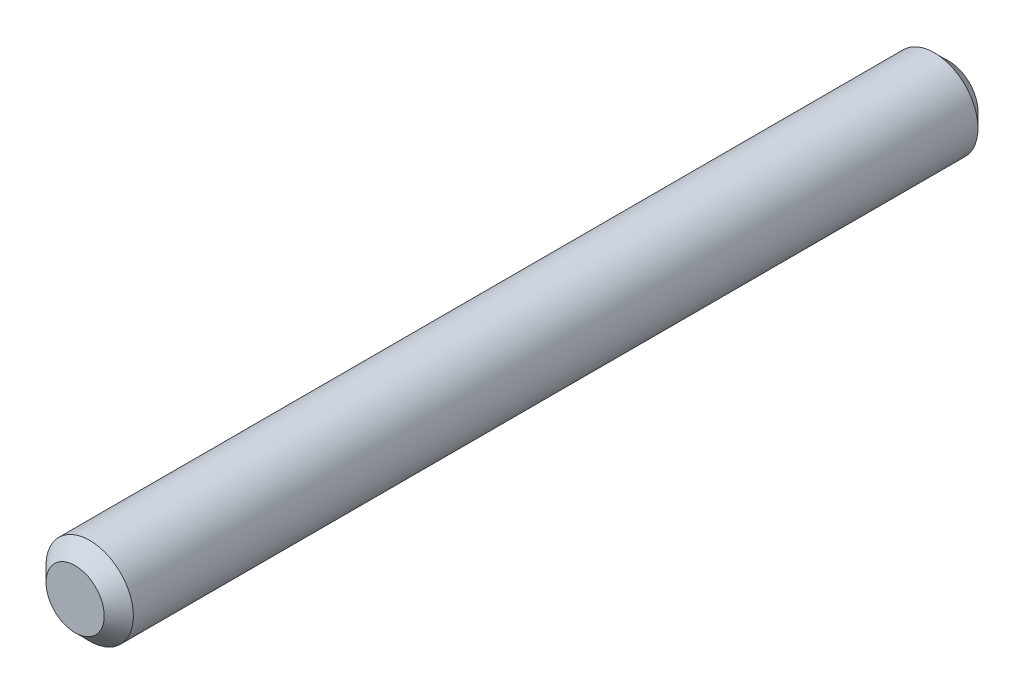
from build123d import *

# Parameters (mm, degrees)
ESQUISSE1_R        = 1.5
BOSS_EXTRU_1_DEPTH = 15
CHANFREIN1_SIZE    = 0.5


with BuildPart() as part:
    # Esquisse1 → Boss.-Extru.1 (new, symmetric)
    with BuildSketch(Plane.XY):
        Circle(ESQUISSE1_R)
    extrude(amount=BOSS_EXTRU_1_DEPTH, both=True)

    # Chanfrein1
    chanfrein1_edges = [part.edges().sort_by_distance(p)[0] for p in [
        (-1.5, 0, -15),
        (-1.5, 0, 15),
    ]]
    chamfer(chanfrein1_edges, length=CHANFREIN1_SIZE)


solid = part.part
